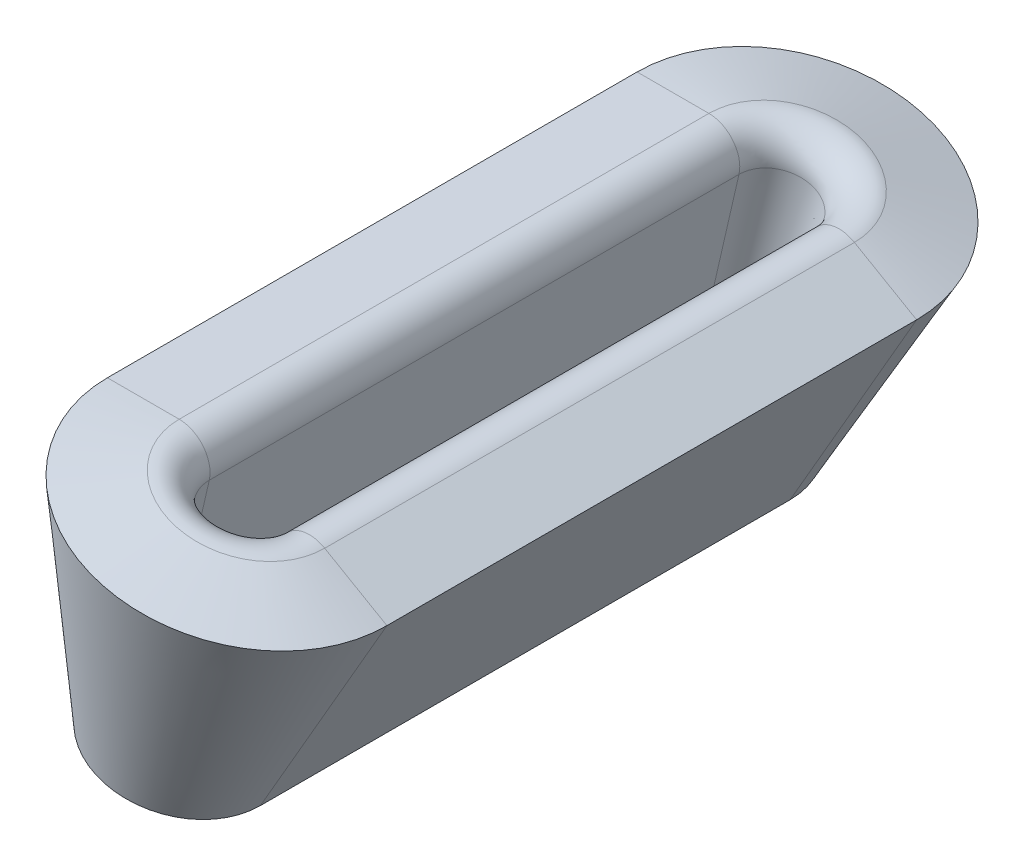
from build123d import *

# Parameters (mm, degrees)
ROTOVAT1_ANGLE          = 180
P_IDAT_VYSUNUT_M1_DEPTH = 51.5
ROTOVAT2_ANGLE          = 180


with BuildPart() as part:
    # Skica2 → Rotovat1 (revolve)
    with BuildSketch(Plane.XY):
        with BuildLine():
            Line((5.1, 30.873414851), (0, 30.873414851))
            Line((0, 30.873414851), (0, 55.473414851))
            Line((0, 55.473414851), (6.982866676, 55.473414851))
            ThreePointArc((6.982866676, 55.473414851), (9.329632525, 54.342288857), (9.906739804, 51.801874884))
            Line((9.906739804, 51.801874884), (5.1, 30.873414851))
        make_face()
    revolve(axis=Axis((7.780085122, 30.155288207, 0), (-0.25881904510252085, -0.9659258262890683, 0)), revolution_arc=ROTOVAT1_ANGLE)

    # Skica3 → P_idat vysunut_m1 (add)
    with BuildSketch(Plane.XY):
        with BuildLine():
            Line((6.982866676, 55.473414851), (0, 55.473414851))
            Line((0, 55.473414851), (0, 30.873414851))
            Line((0, 30.873414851), (5.1, 30.873414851))
            Line((5.1, 30.873414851), (9.906739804, 51.801874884))
            ThreePointArc((9.906739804, 51.801874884), (9.329632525, 54.342288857), (6.982866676, 55.473414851))
        make_face()
        with BuildLine():
            Line((14.876899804, 26.887161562), (10.460170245, 29.437161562))
            Line((10.460170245, 29.437161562), (16.761641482, 49.965109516))
            ThreePointArc((16.761641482, 49.965109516), (18.531638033, 51.876618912), (21.129559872, 51.682819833))
            Line((21.129559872, 51.682819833), (27.176899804, 48.191386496))
            Line((27.176899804, 48.191386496), (14.876899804, 26.887161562))
        make_face()
    extrude(amount=P_IDAT_VYSUNUT_M1_DEPTH)

    # Skica4 → Rotovat2 (revolve)
    with BuildSketch(Plane.XY.offset(51.5)):
        with BuildLine():
            Line((6.982866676, 55.473414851), (0, 55.473414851))
            Line((0, 55.473414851), (0, 30.873414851))
            Line((0, 30.873414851), (5.1, 30.873414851))
            Line((5.1, 30.873414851), (9.906739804, 51.801874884))
            ThreePointArc((9.906739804, 51.801874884), (9.329632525, 54.342288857), (6.982866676, 55.473414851))
        make_face()
    revolve(axis=Axis((13.334190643, 50.8834922, 51.5), (0.2588190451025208, 0.9659258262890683, 0)), revolution_arc=ROTOVAT2_ANGLE)


solid = part.part
